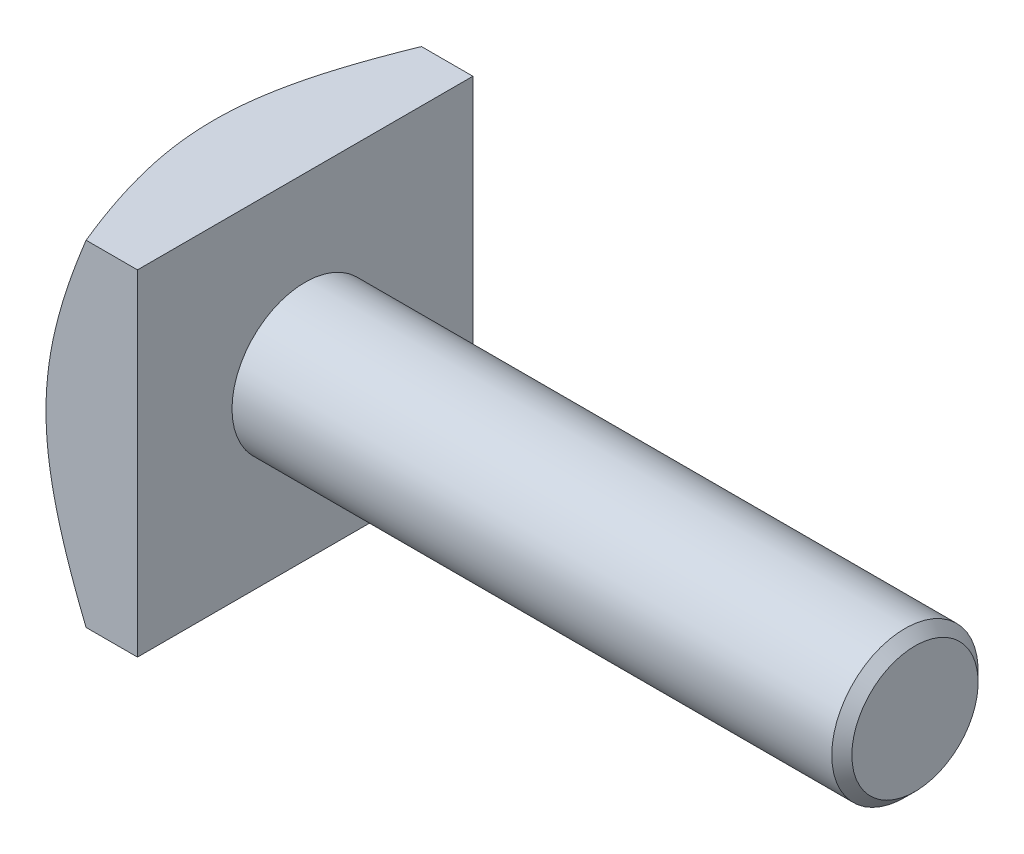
ISO-10303-21;
HEADER;
FILE_DESCRIPTION(('STEP AP214'),'2;1');
FILE_NAME('part.step','',(''),(''),'','','');
FILE_SCHEMA(('AUTOMOTIVE_DESIGN { 1 0 10303 214 1 1 1 1 }'));
ENDSEC;
DATA;
#1=APPLICATION_CONTEXT('core data for automotive mechanical design processes');
#2=APPLICATION_PROTOCOL_DEFINITION('international standard','automotive_design',2000,#1);
#3=PRODUCT_CONTEXT('',#1,'mechanical');
#4=PRODUCT('Part','Part','',(#3));
#5=PRODUCT_RELATED_PRODUCT_CATEGORY('part','',(#4));
#6=PRODUCT_DEFINITION_FORMATION('','',#4);
#7=PRODUCT_DEFINITION_CONTEXT('part definition',#1,'design');
#8=PRODUCT_DEFINITION('design','',#6,#7);
#9=PRODUCT_DEFINITION_SHAPE('','',#8);
#10=(LENGTH_UNIT() NAMED_UNIT(*) SI_UNIT(.MILLI.,.METRE.));
#11=(NAMED_UNIT(*) PLANE_ANGLE_UNIT() SI_UNIT($,.RADIAN.));
#12=(NAMED_UNIT(*) SI_UNIT($,.STERADIAN.) SOLID_ANGLE_UNIT());
#13=UNCERTAINTY_MEASURE_WITH_UNIT(LENGTH_MEASURE(1.E-05),#10,'distance_accuracy_value','');
#14=(GEOMETRIC_REPRESENTATION_CONTEXT(3) GLOBAL_UNCERTAINTY_ASSIGNED_CONTEXT((#13)) GLOBAL_UNIT_ASSIGNED_CONTEXT((#10,
#11,#12)) REPRESENTATION_CONTEXT('',''));
#15=CARTESIAN_POINT('',(0.,0.,0.));
#16=DIRECTION('',(0.,0.,1.));
#17=DIRECTION('',(1.,0.,0.));
#18=AXIS2_PLACEMENT_3D('',#15,#16,#17);
#19=CARTESIAN_POINT('',(15.,27.5,27.5));
#20=DIRECTION('',(0.,-1.,0.));
#21=DIRECTION('',(0.,0.,-1.));
#22=AXIS2_PLACEMENT_3D('',#19,#20,#21);
#23=PLANE('',#22);
#24=CARTESIAN_POINT('',(19.2891533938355,27.5,-54.3484403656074));
#25=CARTESIAN_POINT('',(18.9458184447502,27.5,-53.6819659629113));
#26=CARTESIAN_POINT('',(18.6034944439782,27.5,-53.0149710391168));
#27=CARTESIAN_POINT('',(17.9210859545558,27.5,-51.6798335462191));
#28=CARTESIAN_POINT('',(17.5810014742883,27.5,-51.0116909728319));
#29=CARTESIAN_POINT('',(16.5643984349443,27.5,-49.0053120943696));
#30=CARTESIAN_POINT('',(15.8915699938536,27.5,-47.6652016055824));
#31=CARTESIAN_POINT('',(14.5564181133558,27.5,-44.9758303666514));
#32=CARTESIAN_POINT('',(13.8941230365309,27.5,-43.6265555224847));
#33=CARTESIAN_POINT('',(12.5845998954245,27.5,-40.9207246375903));
#34=CARTESIAN_POINT('',(11.9373715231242,27.5,-39.564168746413));
#35=CARTESIAN_POINT('',(10.9630663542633,27.5,-37.4848533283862));
#36=CARTESIAN_POINT('',(10.6291345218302,27.5,-36.7653040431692));
#37=CARTESIAN_POINT('',(9.96729958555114,27.5,-35.3234400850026));
#38=CARTESIAN_POINT('',(9.63939644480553,27.5,-34.6011254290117));
#39=CARTESIAN_POINT('',(8.99043429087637,27.5,-33.1533670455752));
#40=CARTESIAN_POINT('',(8.66937573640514,27.5,-32.4279231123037));
#41=CARTESIAN_POINT('',(8.03511778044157,27.5,-30.9736050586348));
#42=CARTESIAN_POINT('',(7.72191836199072,27.5,-30.2447309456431));
#43=CARTESIAN_POINT('',(7.10481375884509,27.5,-28.7838030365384));
#44=CARTESIAN_POINT('',(6.80090069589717,27.5,-28.0517525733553));
#45=CARTESIAN_POINT('',(6.2034512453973,27.5,-26.5834130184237));
#46=CARTESIAN_POINT('',(5.90991496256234,27.5,-25.8471238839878));
#47=CARTESIAN_POINT('',(5.33486489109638,27.5,-24.3699401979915));
#48=CARTESIAN_POINT('',(5.05334990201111,27.5,-23.6290461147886));
#49=CARTESIAN_POINT('',(4.50421391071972,27.5,-22.1421407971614));
#50=CARTESIAN_POINT('',(4.23659244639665,27.5,-21.3961297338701));
#51=CARTESIAN_POINT('',(3.72031825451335,27.5,-19.9068050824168));
#52=CARTESIAN_POINT('',(3.47148826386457,27.5,-19.1635531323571));
#53=CARTESIAN_POINT('',(2.99205749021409,27.5,-17.6712555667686));
#54=CARTESIAN_POINT('',(2.76145481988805,27.5,-16.9222105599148));
#55=CARTESIAN_POINT('',(2.32125727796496,27.5,-15.4179904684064));
#56=CARTESIAN_POINT('',(2.11166123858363,27.5,-14.6628157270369));
#57=CARTESIAN_POINT('',(1.71648510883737,27.5,-13.1458870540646));
#58=CARTESIAN_POINT('',(1.53091357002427,27.5,-12.3841308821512));
#59=CARTESIAN_POINT('',(1.19051489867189,27.5,-10.8692661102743));
#60=CARTESIAN_POINT('',(1.03516105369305,27.5,-10.1162765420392));
#61=CARTESIAN_POINT('',(0.753974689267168,27.5,-8.60481213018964));
#62=CARTESIAN_POINT('',(0.628140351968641,27.5,-7.84633762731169));
#63=CARTESIAN_POINT('',(0.408972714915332,27.5,-6.32487928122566));
#64=CARTESIAN_POINT('',(0.315630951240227,27.5,-5.5618966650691));
#65=CARTESIAN_POINT('',(0.163897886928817,27.5,-4.03249534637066));
#66=CARTESIAN_POINT('',(0.105502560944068,27.5,-3.2660770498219));
#67=CARTESIAN_POINT('',(0.0411724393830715,27.5,-2.0349416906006));
#68=CARTESIAN_POINT('',(0.0236233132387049,27.5,-1.57080468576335));
#69=CARTESIAN_POINT('',(0.00207140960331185,27.5,-0.642221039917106));
#70=CARTESIAN_POINT('',(-0.0019317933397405,27.5,-0.17777440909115));
#71=CARTESIAN_POINT('',(0.00365633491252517,27.5,0.750991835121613));
#72=CARTESIAN_POINT('',(0.0132464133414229,27.5,1.21531145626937));
#73=CARTESIAN_POINT('',(0.045910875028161,27.5,2.14347939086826));
#74=CARTESIAN_POINT('',(0.0689854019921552,27.5,2.60732769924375));
#75=CARTESIAN_POINT('',(0.128376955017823,27.5,3.53428731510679));
#76=CARTESIAN_POINT('',(0.164697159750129,27.5,3.99739841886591));
#77=CARTESIAN_POINT('',(0.250192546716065,27.5,4.92243936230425));
#78=CARTESIAN_POINT('',(0.299368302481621,27.5,5.38436914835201));
#79=CARTESIAN_POINT('',(0.465466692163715,27.5,6.7679240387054));
#80=CARTESIAN_POINT('',(0.60096411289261,27.5,7.68737025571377));
#81=CARTESIAN_POINT('',(0.92090866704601,27.5,9.54355013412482));
#82=CARTESIAN_POINT('',(1.10659671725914,27.5,10.4800660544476));
#83=CARTESIAN_POINT('',(1.51905836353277,27.5,12.3439711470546));
#84=CARTESIAN_POINT('',(1.74583266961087,27.5,13.2713601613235));
#85=CARTESIAN_POINT('',(2.11237664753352,27.5,14.6555610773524));
#86=CARTESIAN_POINT('',(2.238987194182,27.5,15.1159192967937));
#87=CARTESIAN_POINT('',(2.50030239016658,27.5,16.0343381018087));
#88=CARTESIAN_POINT('',(2.63500703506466,27.5,16.4923986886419));
#89=CARTESIAN_POINT('',(2.91183323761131,27.5,17.406234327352));
#90=CARTESIAN_POINT('',(3.05395430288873,27.5,17.8620095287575));
#91=CARTESIAN_POINT('',(3.34500261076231,27.5,18.7713766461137));
#92=CARTESIAN_POINT('',(3.4939298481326,27.5,19.2249685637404));
#93=CARTESIAN_POINT('',(3.92985785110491,27.5,20.5225041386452));
#94=CARTESIAN_POINT('',(4.2246003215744,27.5,21.3638532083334));
#95=CARTESIAN_POINT('',(4.83246498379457,27.5,23.0399078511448));
#96=CARTESIAN_POINT('',(5.14558833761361,27.5,23.8746130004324));
#97=CARTESIAN_POINT('',(5.78748401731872,27.5,25.5382017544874));
#98=CARTESIAN_POINT('',(6.11626009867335,27.5,26.3670839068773));
#99=CARTESIAN_POINT('',(6.78704116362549,27.5,28.0194458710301));
#100=CARTESIAN_POINT('',(7.12904589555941,27.5,28.8429257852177));
#101=CARTESIAN_POINT('',(7.82467615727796,27.5,30.4858876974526));
#102=CARTESIAN_POINT('',(8.17831254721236,27.5,31.3053650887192));
#103=CARTESIAN_POINT('',(8.89526950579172,27.5,32.940069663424));
#104=CARTESIAN_POINT('',(9.2585901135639,27.5,33.755296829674));
#105=CARTESIAN_POINT('',(9.99351768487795,27.5,35.3818866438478));
#106=CARTESIAN_POINT('',(10.365123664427,27.5,36.1932497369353));
#107=CARTESIAN_POINT('',(11.1155341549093,27.5,37.8126348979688));
#108=CARTESIAN_POINT('',(11.4943386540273,27.5,38.620656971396));
#109=CARTESIAN_POINT('',(12.2594790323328,27.5,40.2364395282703));
#110=CARTESIAN_POINT('',(12.6458358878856,27.5,41.0441900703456));
#111=CARTESIAN_POINT('',(13.4240464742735,27.5,42.6570404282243));
#112=CARTESIAN_POINT('',(13.8159002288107,27.5,43.4621402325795));
#113=CARTESIAN_POINT('',(14.9986724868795,27.5,45.8739334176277));
#114=CARTESIAN_POINT('',(15.7967909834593,27.5,47.4770974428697));
#115=CARTESIAN_POINT('',(17.4074889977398,27.5,50.6750172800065));
#116=CARTESIAN_POINT('',(18.220060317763,27.5,52.2697772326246));
#117=CARTESIAN_POINT('',(19.8569996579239,27.5,55.4532089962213));
#118=CARTESIAN_POINT('',(20.6813675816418,27.5,57.0418808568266));
#119=CARTESIAN_POINT('',(22.227938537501,27.5,60.0006536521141));
#120=CARTESIAN_POINT('',(22.9489499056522,27.5,61.3713782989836));
#121=CARTESIAN_POINT('',(24.3969253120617,27.5,64.1096818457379));
#122=CARTESIAN_POINT('',(25.1238893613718,27.5,65.4772607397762));
#123=CARTESIAN_POINT('',(26.5829525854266,27.5,68.2099451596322));
#124=CARTESIAN_POINT('',(27.3150525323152,27.5,69.5750502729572));
#125=CARTESIAN_POINT('',(28.7835313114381,27.5,72.302957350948));
#126=CARTESIAN_POINT('',(29.5199101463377,27.5,73.6657593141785));
#127=CARTESIAN_POINT('',(30.9913075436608,27.5,76.3800929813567));
#128=CARTESIAN_POINT('',(31.7263011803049,27.5,77.7316382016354));
#129=CARTESIAN_POINT('',(33.1994205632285,27.5,80.4330209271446));
#130=CARTESIAN_POINT('',(33.9375463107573,27.5,81.7828584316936));
#131=CARTESIAN_POINT('',(35.4163878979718,27.5,84.4807988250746));
#132=CARTESIAN_POINT('',(36.1571032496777,27.5,85.8289019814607));
#133=CARTESIAN_POINT('',(37.640926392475,27.5,88.5237882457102));
#134=CARTESIAN_POINT('',(38.3840341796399,27.5,89.8705713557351));
#135=CARTESIAN_POINT('',(39.1281747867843,27.5,91.2167827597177));
#136=B_SPLINE_CURVE_WITH_KNOTS('',3,(#24,#25,#26,#27,#28,#29,#30,#31,#32,#33,#34,#35,#36,#37,
#38,#39,#40,#41,#42,#43,#44,#45,#46,#47,#48,#49,#50,#51,#52,#53,#54,#55,#56,#57,#58,#59,#60,#61,
#62,#63,#64,#65,#66,#67,#68,#69,#70,#71,#72,#73,#74,#75,#76,#77,#78,#79,#80,#81,#82,#83,#84,#85,
#86,#87,#88,#89,#90,#91,#92,#93,#94,#95,#96,#97,#98,#99,#100,#101,#102,#103,#104,#105,#106,#107,
#108,#109,#110,#111,#112,#113,#114,#115,#116,#117,#118,#119,#120,#121,#122,#123,#124,#125,#126,
#127,#128,#129,#130,#131,#132,#133,#134,#135),.UNSPECIFIED.,.F.,.F.,(4,2,2,2,2,2,2,2,2,2,2,2,2,
2,2,2,2,2,2,2,2,2,2,2,2,2,2,2,2,2,2,2,2,2,2,2,2,2,2,2,2,2,2,2,2,2,2,2,2,2,2,2,2,2,2,4),(0.,
2.2491320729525,4.49827255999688,8.99681337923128,13.5059126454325,18.0149196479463,
20.3946776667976,22.7744211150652,25.1543235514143,27.5342208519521,29.9120396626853,
32.2898824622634,34.6674872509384,37.0450129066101,39.3962057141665,41.7471547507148,
44.0979730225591,46.4496257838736,48.7556452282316,51.0615226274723,53.3667989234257,
55.6718096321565,57.0650406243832,58.4582278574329,59.8512867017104,61.2443603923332,
62.6377686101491,64.0312390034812,66.8180129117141,69.681239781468,72.5445161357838,
73.9768128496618,75.4091087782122,76.8413097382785,78.2735095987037,80.9476779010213,
83.6220154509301,86.2969979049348,88.9719294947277,91.6494337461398,94.3269488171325,
97.004147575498,99.6813419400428,102.367503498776,105.053676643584,110.426099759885,
115.795567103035,121.164990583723,125.811337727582,130.457693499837,135.104763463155,
139.751836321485,144.367241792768,148.982649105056,153.597229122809,158.211801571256),.UNSPECIFIED.);
#137=CARTESIAN_POINT('',(6.57652357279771,27.5,27.5));
#138=VERTEX_POINT('',#137);
#139=CARTESIAN_POINT('',(0.,27.5,0.));
#140=VERTEX_POINT('',#139);
#141=EDGE_CURVE('E86',#138,#140,#136,.F.);
#142=ORIENTED_EDGE('',*,*,#141,.F.);
#143=DIRECTION('',(-1.,0.,0.));
#144=VECTOR('',#143,1.);
#145=CARTESIAN_POINT('',(15.,27.5,27.5));
#146=LINE('',#145,#144);
#147=CARTESIAN_POINT('',(15.,27.5,27.5));
#148=VERTEX_POINT('',#147);
#149=EDGE_CURVE('E176',#148,#138,#146,.T.);
#150=ORIENTED_EDGE('',*,*,#149,.F.);
#151=DIRECTION('',(0.,0.,1.));
#152=VECTOR('',#151,1.);
#153=CARTESIAN_POINT('',(15.,27.5,27.5));
#154=LINE('',#153,#152);
#155=CARTESIAN_POINT('',(15.,27.5,-27.5));
#156=VERTEX_POINT('',#155);
#157=EDGE_CURVE('E189',#156,#148,#154,.T.);
#158=ORIENTED_EDGE('',*,*,#157,.F.);
#159=DIRECTION('',(-1.,0.,0.));
#160=VECTOR('',#159,1.);
#161=CARTESIAN_POINT('',(15.,27.5,-27.5));
#162=LINE('',#161,#160);
#163=CARTESIAN_POINT('',(6.57652357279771,27.5,-27.5));
#164=VERTEX_POINT('',#163);
#165=EDGE_CURVE('E111',#156,#164,#162,.T.);
#166=ORIENTED_EDGE('',*,*,#165,.T.);
#167=EDGE_CURVE('E95',#140,#164,#136,.F.);
#168=ORIENTED_EDGE('',*,*,#167,.F.);
#169=EDGE_LOOP('',(#142,#150,#158,#166,#168));
#170=FACE_BOUND('',#169,.T.);
#171=ADVANCED_FACE('F35',(#170),#23,.F.);
#172=CARTESIAN_POINT('',(15.,27.5,27.5));
#173=DIRECTION('',(0.,0.,-1.));
#174=DIRECTION('',(0.,1.,0.));
#175=AXIS2_PLACEMENT_3D('',#172,#173,#174);
#176=PLANE('',#175);
#177=CARTESIAN_POINT('',(19.2891533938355,-54.3484403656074,27.5));
#178=CARTESIAN_POINT('',(18.9458184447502,-53.6819659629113,27.5));
#179=CARTESIAN_POINT('',(18.6034944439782,-53.0149710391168,27.5));
#180=CARTESIAN_POINT('',(17.9210859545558,-51.6798335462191,27.5));
#181=CARTESIAN_POINT('',(17.5810014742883,-51.0116909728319,27.5));
#182=CARTESIAN_POINT('',(16.5643984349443,-49.0053120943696,27.5));
#183=CARTESIAN_POINT('',(15.8915699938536,-47.6652016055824,27.5));
#184=CARTESIAN_POINT('',(14.5564181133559,-44.9758303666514,27.5));
#185=CARTESIAN_POINT('',(13.8941230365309,-43.6265555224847,27.5));
#186=CARTESIAN_POINT('',(12.5845998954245,-40.9207246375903,27.5));
#187=CARTESIAN_POINT('',(11.9373715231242,-39.564168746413,27.5));
#188=CARTESIAN_POINT('',(10.9630663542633,-37.4848533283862,27.5));
#189=CARTESIAN_POINT('',(10.6291345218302,-36.7653040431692,27.5));
#190=CARTESIAN_POINT('',(9.96729958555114,-35.3234400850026,27.5));
#191=CARTESIAN_POINT('',(9.63939644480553,-34.6011254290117,27.5));
#192=CARTESIAN_POINT('',(8.99043429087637,-33.1533670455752,27.5));
#193=CARTESIAN_POINT('',(8.66937573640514,-32.4279231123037,27.5));
#194=CARTESIAN_POINT('',(8.03511778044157,-30.9736050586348,27.5));
#195=CARTESIAN_POINT('',(7.72191836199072,-30.2447309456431,27.5));
#196=CARTESIAN_POINT('',(7.10481375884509,-28.7838030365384,27.5));
#197=CARTESIAN_POINT('',(6.80090069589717,-28.0517525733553,27.5));
#198=CARTESIAN_POINT('',(6.20345124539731,-26.5834130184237,27.5));
#199=CARTESIAN_POINT('',(5.90991496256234,-25.8471238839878,27.5));
#200=CARTESIAN_POINT('',(5.33486489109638,-24.3699401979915,27.5));
#201=CARTESIAN_POINT('',(5.05334990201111,-23.6290461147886,27.5));
#202=CARTESIAN_POINT('',(4.50421391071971,-22.1421407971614,27.5));
#203=CARTESIAN_POINT('',(4.23659244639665,-21.3961297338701,27.5));
#204=CARTESIAN_POINT('',(3.72031825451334,-19.9068050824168,27.5));
#205=CARTESIAN_POINT('',(3.47148826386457,-19.1635531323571,27.5));
#206=CARTESIAN_POINT('',(2.99205749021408,-17.6712555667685,27.5));
#207=CARTESIAN_POINT('',(2.76145481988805,-16.9222105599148,27.5));
#208=CARTESIAN_POINT('',(2.32125727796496,-15.4179904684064,27.5));
#209=CARTESIAN_POINT('',(2.11166123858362,-14.6628157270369,27.5));
#210=CARTESIAN_POINT('',(1.71648510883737,-13.1458870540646,27.5));
#211=CARTESIAN_POINT('',(1.53091357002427,-12.3841308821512,27.5));
#212=CARTESIAN_POINT('',(1.19051489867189,-10.8692661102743,27.5));
#213=CARTESIAN_POINT('',(1.03516105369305,-10.1162765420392,27.5));
#214=CARTESIAN_POINT('',(0.753974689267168,-8.60481213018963,27.5));
#215=CARTESIAN_POINT('',(0.628140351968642,-7.84633762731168,27.5));
#216=CARTESIAN_POINT('',(0.408972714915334,-6.32487928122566,27.5));
#217=CARTESIAN_POINT('',(0.315630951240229,-5.56189666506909,27.5));
#218=CARTESIAN_POINT('',(0.163897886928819,-4.03249534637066,27.5));
#219=CARTESIAN_POINT('',(0.10550256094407,-3.2660770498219,27.5));
#220=CARTESIAN_POINT('',(0.0411724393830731,-2.0349416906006,27.5));
#221=CARTESIAN_POINT('',(0.0236233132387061,-1.57080468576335,27.5));
#222=CARTESIAN_POINT('',(0.00207140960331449,-0.642221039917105,27.5));
#223=CARTESIAN_POINT('',(-0.00193179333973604,-0.177774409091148,27.5));
#224=CARTESIAN_POINT('',(0.00365633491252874,0.750991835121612,27.5));
#225=CARTESIAN_POINT('',(0.0132464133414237,1.21531145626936,27.5));
#226=CARTESIAN_POINT('',(0.0459108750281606,2.14347939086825,27.5));
#227=CARTESIAN_POINT('',(0.0689854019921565,2.60732769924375,27.5));
#228=CARTESIAN_POINT('',(0.128376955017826,3.5342873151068,27.5));
#229=CARTESIAN_POINT('',(0.164697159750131,3.99739841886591,27.5));
#230=CARTESIAN_POINT('',(0.250192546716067,4.92243936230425,27.5));
#231=CARTESIAN_POINT('',(0.299368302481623,5.38436914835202,27.5));
#232=CARTESIAN_POINT('',(0.465466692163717,6.7679240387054,27.5));
#233=CARTESIAN_POINT('',(0.600964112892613,7.68737025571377,27.5));
#234=CARTESIAN_POINT('',(0.920908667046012,9.54355013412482,27.5));
#235=CARTESIAN_POINT('',(1.10659671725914,10.4800660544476,27.5));
#236=CARTESIAN_POINT('',(1.51905836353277,12.3439711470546,27.5));
#237=CARTESIAN_POINT('',(1.74583266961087,13.2713601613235,27.5));
#238=CARTESIAN_POINT('',(2.11237664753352,14.6555610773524,27.5));
#239=CARTESIAN_POINT('',(2.238987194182,15.1159192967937,27.5));
#240=CARTESIAN_POINT('',(2.50030239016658,16.0343381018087,27.5));
#241=CARTESIAN_POINT('',(2.63500703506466,16.4923986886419,27.5));
#242=CARTESIAN_POINT('',(2.9118332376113,17.406234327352,27.5));
#243=CARTESIAN_POINT('',(3.05395430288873,17.8620095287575,27.5));
#244=CARTESIAN_POINT('',(3.34500261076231,18.7713766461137,27.5));
#245=CARTESIAN_POINT('',(3.4939298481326,19.2249685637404,27.5));
#246=CARTESIAN_POINT('',(3.92985785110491,20.5225041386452,27.5));
#247=CARTESIAN_POINT('',(4.2246003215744,21.3638532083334,27.5));
#248=CARTESIAN_POINT('',(4.83246498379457,23.0399078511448,27.5));
#249=CARTESIAN_POINT('',(5.14558833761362,23.8746130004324,27.5));
#250=CARTESIAN_POINT('',(5.78748401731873,25.5382017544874,27.5));
#251=CARTESIAN_POINT('',(6.11626009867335,26.3670839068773,27.5));
#252=CARTESIAN_POINT('',(6.78704116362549,28.0194458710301,27.5));
#253=CARTESIAN_POINT('',(7.12904589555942,28.8429257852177,27.5));
#254=CARTESIAN_POINT('',(7.82467615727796,30.4858876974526,27.5));
#255=CARTESIAN_POINT('',(8.17831254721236,31.3053650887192,27.5));
#256=CARTESIAN_POINT('',(8.89526950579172,32.940069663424,27.5));
#257=CARTESIAN_POINT('',(9.2585901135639,33.755296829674,27.5));
#258=CARTESIAN_POINT('',(9.99351768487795,35.3818866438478,27.5));
#259=CARTESIAN_POINT('',(10.365123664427,36.1932497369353,27.5));
#260=CARTESIAN_POINT('',(11.1155341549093,37.8126348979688,27.5));
#261=CARTESIAN_POINT('',(11.4943386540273,38.620656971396,27.5));
#262=CARTESIAN_POINT('',(12.2594790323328,40.2364395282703,27.5));
#263=CARTESIAN_POINT('',(12.6458358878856,41.0441900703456,27.5));
#264=CARTESIAN_POINT('',(13.4240464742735,42.6570404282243,27.5));
#265=CARTESIAN_POINT('',(13.8159002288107,43.4621402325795,27.5));
#266=CARTESIAN_POINT('',(14.9986724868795,45.8739334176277,27.5));
#267=CARTESIAN_POINT('',(15.7967909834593,47.4770974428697,27.5));
#268=CARTESIAN_POINT('',(17.4074889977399,50.6750172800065,27.5));
#269=CARTESIAN_POINT('',(18.220060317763,52.2697772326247,27.5));
#270=CARTESIAN_POINT('',(19.8569996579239,55.4532089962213,27.5));
#271=CARTESIAN_POINT('',(20.6813675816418,57.0418808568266,27.5));
#272=CARTESIAN_POINT('',(22.227938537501,60.0006536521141,27.5));
#273=CARTESIAN_POINT('',(22.9489499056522,61.3713782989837,27.5));
#274=CARTESIAN_POINT('',(24.3969253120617,64.109681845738,27.5));
#275=CARTESIAN_POINT('',(25.1238893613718,65.4772607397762,27.5));
#276=CARTESIAN_POINT('',(26.5829525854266,68.2099451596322,27.5));
#277=CARTESIAN_POINT('',(27.3150525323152,69.5750502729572,27.5));
#278=CARTESIAN_POINT('',(28.7835313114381,72.302957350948,27.5));
#279=CARTESIAN_POINT('',(29.5199101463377,73.6657593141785,27.5));
#280=CARTESIAN_POINT('',(30.9913075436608,76.3800929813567,27.5));
#281=CARTESIAN_POINT('',(31.7263011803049,77.7316382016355,27.5));
#282=CARTESIAN_POINT('',(33.1994205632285,80.4330209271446,27.5));
#283=CARTESIAN_POINT('',(33.9375463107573,81.7828584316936,27.5));
#284=CARTESIAN_POINT('',(35.4163878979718,84.4807988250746,27.5));
#285=CARTESIAN_POINT('',(36.1571032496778,85.8289019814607,27.5));
#286=CARTESIAN_POINT('',(37.640926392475,88.5237882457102,27.5));
#287=CARTESIAN_POINT('',(38.3840341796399,89.8705713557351,27.5));
#288=CARTESIAN_POINT('',(39.1281747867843,91.2167827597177,27.5));
#289=B_SPLINE_CURVE_WITH_KNOTS('',3,(#177,#178,#179,#180,#181,#182,#183,#184,#185,#186,#187,
#188,#189,#190,#191,#192,#193,#194,#195,#196,#197,#198,#199,#200,#201,#202,#203,#204,#205,#206,
#207,#208,#209,#210,#211,#212,#213,#214,#215,#216,#217,#218,#219,#220,#221,#222,#223,#224,#225,
#226,#227,#228,#229,#230,#231,#232,#233,#234,#235,#236,#237,#238,#239,#240,#241,#242,#243,#244,
#245,#246,#247,#248,#249,#250,#251,#252,#253,#254,#255,#256,#257,#258,#259,#260,#261,#262,#263,
#264,#265,#266,#267,#268,#269,#270,#271,#272,#273,#274,#275,#276,#277,#278,#279,#280,#281,#282,
#283,#284,#285,#286,#287,#288),.UNSPECIFIED.,.F.,.F.,(4,2,2,2,2,2,2,2,2,2,2,2,2,2,2,2,2,2,2,2,2,
2,2,2,2,2,2,2,2,2,2,2,2,2,2,2,2,2,2,2,2,2,2,2,2,2,2,2,2,2,2,2,2,2,2,4),(0.,2.2491320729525,
4.49827255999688,8.99681337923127,13.5059126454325,18.0149196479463,20.3946776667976,
22.7744211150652,25.1543235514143,27.5342208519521,29.9120396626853,32.2898824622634,
34.6674872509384,37.0450129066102,39.3962057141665,41.7471547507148,44.0979730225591,
46.4496257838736,48.7556452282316,51.0615226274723,53.3667989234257,55.6718096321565,
57.0650406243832,58.4582278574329,59.8512867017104,61.2443603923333,62.6377686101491,
64.0312390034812,66.8180129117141,69.681239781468,72.5445161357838,73.9768128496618,
75.4091087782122,76.8413097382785,78.2735095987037,80.9476779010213,83.6220154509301,
86.2969979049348,88.9719294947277,91.6494337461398,94.3269488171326,97.0041475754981,
99.6813419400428,102.367503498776,105.053676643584,110.426099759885,115.795567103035,
121.164990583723,125.811337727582,130.457693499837,135.104763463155,139.751836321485,
144.367241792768,148.982649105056,153.597229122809,158.211801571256),.UNSPECIFIED.);
#290=CARTESIAN_POINT('',(6.57652357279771,-27.5,27.5));
#291=VERTEX_POINT('',#290);
#292=CARTESIAN_POINT('',(0.,0.,27.5));
#293=VERTEX_POINT('',#292);
#294=EDGE_CURVE('E167',#291,#293,#289,.T.);
#295=ORIENTED_EDGE('',*,*,#294,.F.);
#296=DIRECTION('',(-1.,0.,0.));
#297=VECTOR('',#296,1.);
#298=CARTESIAN_POINT('',(15.,-27.5,27.5));
#299=LINE('',#298,#297);
#300=CARTESIAN_POINT('',(15.,-27.5,27.5));
#301=VERTEX_POINT('',#300);
#302=EDGE_CURVE('E169',#301,#291,#299,.T.);
#303=ORIENTED_EDGE('',*,*,#302,.F.);
#304=DIRECTION('',(0.,-1.,0.));
#305=VECTOR('',#304,1.);
#306=CARTESIAN_POINT('',(15.,27.5,27.5));
#307=LINE('',#306,#305);
#308=EDGE_CURVE('E187',#148,#301,#307,.T.);
#309=ORIENTED_EDGE('',*,*,#308,.F.);
#310=ORIENTED_EDGE('',*,*,#149,.T.);
#311=EDGE_CURVE('E89',#293,#138,#289,.T.);
#312=ORIENTED_EDGE('',*,*,#311,.F.);
#313=EDGE_LOOP('',(#295,#303,#309,#310,#312));
#314=FACE_BOUND('',#313,.T.);
#315=ADVANCED_FACE('F157',(#314),#176,.F.);
#316=CARTESIAN_POINT('',(15.,-27.5,27.5));
#317=DIRECTION('',(0.,1.,0.));
#318=DIRECTION('',(0.,0.,1.));
#319=AXIS2_PLACEMENT_3D('',#316,#317,#318);
#320=PLANE('',#319);
#321=CARTESIAN_POINT('',(19.2891533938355,-27.5,-54.3484403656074));
#322=CARTESIAN_POINT('',(18.9458184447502,-27.5,-53.6819659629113));
#323=CARTESIAN_POINT('',(18.6034944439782,-27.5,-53.0149710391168));
#324=CARTESIAN_POINT('',(17.9210859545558,-27.5,-51.6798335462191));
#325=CARTESIAN_POINT('',(17.5810014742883,-27.5,-51.0116909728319));
#326=CARTESIAN_POINT('',(16.5643984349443,-27.5,-49.0053120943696));
#327=CARTESIAN_POINT('',(15.8915699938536,-27.5,-47.6652016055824));
#328=CARTESIAN_POINT('',(14.5564181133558,-27.5,-44.9758303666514));
#329=CARTESIAN_POINT('',(13.8941230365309,-27.5,-43.6265555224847));
#330=CARTESIAN_POINT('',(12.5845998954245,-27.5,-40.9207246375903));
#331=CARTESIAN_POINT('',(11.9373715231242,-27.5,-39.564168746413));
#332=CARTESIAN_POINT('',(10.9630663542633,-27.5,-37.4848533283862));
#333=CARTESIAN_POINT('',(10.6291345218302,-27.5,-36.7653040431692));
#334=CARTESIAN_POINT('',(9.96729958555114,-27.5,-35.3234400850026));
#335=CARTESIAN_POINT('',(9.63939644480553,-27.5,-34.6011254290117));
#336=CARTESIAN_POINT('',(8.99043429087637,-27.5,-33.1533670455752));
#337=CARTESIAN_POINT('',(8.66937573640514,-27.5,-32.4279231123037));
#338=CARTESIAN_POINT('',(8.03511778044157,-27.5,-30.9736050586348));
#339=CARTESIAN_POINT('',(7.72191836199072,-27.5,-30.2447309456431));
#340=CARTESIAN_POINT('',(7.10481375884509,-27.5,-28.7838030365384));
#341=CARTESIAN_POINT('',(6.80090069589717,-27.5,-28.0517525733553));
#342=CARTESIAN_POINT('',(6.2034512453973,-27.5,-26.5834130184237));
#343=CARTESIAN_POINT('',(5.90991496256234,-27.5,-25.8471238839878));
#344=CARTESIAN_POINT('',(5.33486489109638,-27.5,-24.3699401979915));
#345=CARTESIAN_POINT('',(5.05334990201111,-27.5,-23.6290461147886));
#346=CARTESIAN_POINT('',(4.50421391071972,-27.5,-22.1421407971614));
#347=CARTESIAN_POINT('',(4.23659244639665,-27.5,-21.3961297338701));
#348=CARTESIAN_POINT('',(3.72031825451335,-27.5,-19.9068050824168));
#349=CARTESIAN_POINT('',(3.47148826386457,-27.5,-19.1635531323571));
#350=CARTESIAN_POINT('',(2.99205749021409,-27.5,-17.6712555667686));
#351=CARTESIAN_POINT('',(2.76145481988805,-27.5,-16.9222105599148));
#352=CARTESIAN_POINT('',(2.32125727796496,-27.5,-15.4179904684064));
#353=CARTESIAN_POINT('',(2.11166123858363,-27.5,-14.6628157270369));
#354=CARTESIAN_POINT('',(1.71648510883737,-27.5,-13.1458870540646));
#355=CARTESIAN_POINT('',(1.53091357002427,-27.5,-12.3841308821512));
#356=CARTESIAN_POINT('',(1.19051489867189,-27.5,-10.8692661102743));
#357=CARTESIAN_POINT('',(1.03516105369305,-27.5,-10.1162765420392));
#358=CARTESIAN_POINT('',(0.753974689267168,-27.5,-8.60481213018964));
#359=CARTESIAN_POINT('',(0.628140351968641,-27.5,-7.84633762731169));
#360=CARTESIAN_POINT('',(0.408972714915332,-27.5,-6.32487928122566));
#361=CARTESIAN_POINT('',(0.315630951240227,-27.5,-5.5618966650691));
#362=CARTESIAN_POINT('',(0.163897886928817,-27.5,-4.03249534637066));
#363=CARTESIAN_POINT('',(0.105502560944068,-27.5,-3.2660770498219));
#364=CARTESIAN_POINT('',(0.0411724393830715,-27.5,-2.0349416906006));
#365=CARTESIAN_POINT('',(0.0236233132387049,-27.5,-1.57080468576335));
#366=CARTESIAN_POINT('',(0.00207140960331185,-27.5,-0.642221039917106));
#367=CARTESIAN_POINT('',(-0.0019317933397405,-27.5,-0.17777440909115));
#368=CARTESIAN_POINT('',(0.00365633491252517,-27.5,0.750991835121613));
#369=CARTESIAN_POINT('',(0.0132464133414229,-27.5,1.21531145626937));
#370=CARTESIAN_POINT('',(0.045910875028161,-27.5,2.14347939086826));
#371=CARTESIAN_POINT('',(0.0689854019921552,-27.5,2.60732769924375));
#372=CARTESIAN_POINT('',(0.128376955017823,-27.5,3.53428731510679));
#373=CARTESIAN_POINT('',(0.164697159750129,-27.5,3.99739841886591));
#374=CARTESIAN_POINT('',(0.250192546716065,-27.5,4.92243936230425));
#375=CARTESIAN_POINT('',(0.299368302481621,-27.5,5.38436914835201));
#376=CARTESIAN_POINT('',(0.465466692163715,-27.5,6.7679240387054));
#377=CARTESIAN_POINT('',(0.60096411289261,-27.5,7.68737025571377));
#378=CARTESIAN_POINT('',(0.92090866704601,-27.5,9.54355013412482));
#379=CARTESIAN_POINT('',(1.10659671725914,-27.5,10.4800660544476));
#380=CARTESIAN_POINT('',(1.51905836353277,-27.5,12.3439711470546));
#381=CARTESIAN_POINT('',(1.74583266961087,-27.5,13.2713601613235));
#382=CARTESIAN_POINT('',(2.11237664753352,-27.5,14.6555610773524));
#383=CARTESIAN_POINT('',(2.238987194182,-27.5,15.1159192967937));
#384=CARTESIAN_POINT('',(2.50030239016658,-27.5,16.0343381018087));
#385=CARTESIAN_POINT('',(2.63500703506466,-27.5,16.4923986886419));
#386=CARTESIAN_POINT('',(2.91183323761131,-27.5,17.406234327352));
#387=CARTESIAN_POINT('',(3.05395430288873,-27.5,17.8620095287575));
#388=CARTESIAN_POINT('',(3.34500261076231,-27.5,18.7713766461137));
#389=CARTESIAN_POINT('',(3.4939298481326,-27.5,19.2249685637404));
#390=CARTESIAN_POINT('',(3.92985785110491,-27.5,20.5225041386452));
#391=CARTESIAN_POINT('',(4.2246003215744,-27.5,21.3638532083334));
#392=CARTESIAN_POINT('',(4.83246498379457,-27.5,23.0399078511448));
#393=CARTESIAN_POINT('',(5.14558833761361,-27.5,23.8746130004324));
#394=CARTESIAN_POINT('',(5.78748401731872,-27.5,25.5382017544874));
#395=CARTESIAN_POINT('',(6.11626009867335,-27.5,26.3670839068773));
#396=CARTESIAN_POINT('',(6.78704116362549,-27.5,28.0194458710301));
#397=CARTESIAN_POINT('',(7.12904589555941,-27.5,28.8429257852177));
#398=CARTESIAN_POINT('',(7.82467615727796,-27.5,30.4858876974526));
#399=CARTESIAN_POINT('',(8.17831254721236,-27.5,31.3053650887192));
#400=CARTESIAN_POINT('',(8.89526950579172,-27.5,32.940069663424));
#401=CARTESIAN_POINT('',(9.2585901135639,-27.5,33.755296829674));
#402=CARTESIAN_POINT('',(9.99351768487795,-27.5,35.3818866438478));
#403=CARTESIAN_POINT('',(10.365123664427,-27.5,36.1932497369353));
#404=CARTESIAN_POINT('',(11.1155341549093,-27.5,37.8126348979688));
#405=CARTESIAN_POINT('',(11.4943386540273,-27.5,38.620656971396));
#406=CARTESIAN_POINT('',(12.2594790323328,-27.5,40.2364395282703));
#407=CARTESIAN_POINT('',(12.6458358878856,-27.5,41.0441900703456));
#408=CARTESIAN_POINT('',(13.4240464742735,-27.5,42.6570404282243));
#409=CARTESIAN_POINT('',(13.8159002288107,-27.5,43.4621402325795));
#410=CARTESIAN_POINT('',(14.9986724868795,-27.5,45.8739334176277));
#411=CARTESIAN_POINT('',(15.7967909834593,-27.5,47.4770974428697));
#412=CARTESIAN_POINT('',(17.4074889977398,-27.5,50.6750172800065));
#413=CARTESIAN_POINT('',(18.220060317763,-27.5,52.2697772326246));
#414=CARTESIAN_POINT('',(19.8569996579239,-27.5,55.4532089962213));
#415=CARTESIAN_POINT('',(20.6813675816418,-27.5,57.0418808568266));
#416=CARTESIAN_POINT('',(22.227938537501,-27.5,60.0006536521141));
#417=CARTESIAN_POINT('',(22.9489499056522,-27.5,61.3713782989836));
#418=CARTESIAN_POINT('',(24.3969253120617,-27.5,64.1096818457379));
#419=CARTESIAN_POINT('',(25.1238893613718,-27.5,65.4772607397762));
#420=CARTESIAN_POINT('',(26.5829525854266,-27.5,68.2099451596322));
#421=CARTESIAN_POINT('',(27.3150525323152,-27.5,69.5750502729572));
#422=CARTESIAN_POINT('',(28.7835313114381,-27.5,72.302957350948));
#423=CARTESIAN_POINT('',(29.5199101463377,-27.5,73.6657593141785));
#424=CARTESIAN_POINT('',(30.9913075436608,-27.5,76.3800929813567));
#425=CARTESIAN_POINT('',(31.7263011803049,-27.5,77.7316382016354));
#426=CARTESIAN_POINT('',(33.1994205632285,-27.5,80.4330209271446));
#427=CARTESIAN_POINT('',(33.9375463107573,-27.5,81.7828584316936));
#428=CARTESIAN_POINT('',(35.4163878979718,-27.5,84.4807988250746));
#429=CARTESIAN_POINT('',(36.1571032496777,-27.5,85.8289019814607));
#430=CARTESIAN_POINT('',(37.640926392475,-27.5,88.5237882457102));
#431=CARTESIAN_POINT('',(38.3840341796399,-27.5,89.8705713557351));
#432=CARTESIAN_POINT('',(39.1281747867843,-27.5,91.2167827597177));
#433=B_SPLINE_CURVE_WITH_KNOTS('',3,(#321,#322,#323,#324,#325,#326,#327,#328,#329,#330,#331,
#332,#333,#334,#335,#336,#337,#338,#339,#340,#341,#342,#343,#344,#345,#346,#347,#348,#349,#350,
#351,#352,#353,#354,#355,#356,#357,#358,#359,#360,#361,#362,#363,#364,#365,#366,#367,#368,#369,
#370,#371,#372,#373,#374,#375,#376,#377,#378,#379,#380,#381,#382,#383,#384,#385,#386,#387,#388,
#389,#390,#391,#392,#393,#394,#395,#396,#397,#398,#399,#400,#401,#402,#403,#404,#405,#406,#407,
#408,#409,#410,#411,#412,#413,#414,#415,#416,#417,#418,#419,#420,#421,#422,#423,#424,#425,#426,
#427,#428,#429,#430,#431,#432),.UNSPECIFIED.,.F.,.F.,(4,2,2,2,2,2,2,2,2,2,2,2,2,2,2,2,2,2,2,2,2,
2,2,2,2,2,2,2,2,2,2,2,2,2,2,2,2,2,2,2,2,2,2,2,2,2,2,2,2,2,2,2,2,2,2,4),(0.,2.2491320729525,
4.49827255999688,8.99681337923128,13.5059126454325,18.0149196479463,20.3946776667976,
22.7744211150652,25.1543235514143,27.5342208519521,29.9120396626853,32.2898824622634,
34.6674872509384,37.0450129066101,39.3962057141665,41.7471547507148,44.0979730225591,
46.4496257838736,48.7556452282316,51.0615226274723,53.3667989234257,55.6718096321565,
57.0650406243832,58.4582278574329,59.8512867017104,61.2443603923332,62.6377686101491,
64.0312390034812,66.8180129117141,69.681239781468,72.5445161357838,73.9768128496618,
75.4091087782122,76.8413097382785,78.2735095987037,80.9476779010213,83.6220154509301,
86.2969979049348,88.9719294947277,91.6494337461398,94.3269488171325,97.004147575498,
99.6813419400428,102.367503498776,105.053676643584,110.426099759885,115.795567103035,
121.164990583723,125.811337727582,130.457693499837,135.104763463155,139.751836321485,
144.367241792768,148.982649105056,153.597229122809,158.211801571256),.UNSPECIFIED.);
#434=CARTESIAN_POINT('',(6.57652357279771,-27.5,-27.5));
#435=VERTEX_POINT('',#434);
#436=CARTESIAN_POINT('',(0.,-27.5,0.));
#437=VERTEX_POINT('',#436);
#438=EDGE_CURVE('E112',#435,#437,#433,.T.);
#439=ORIENTED_EDGE('',*,*,#438,.F.);
#440=DIRECTION('',(-1.,0.,0.));
#441=VECTOR('',#440,1.);
#442=CARTESIAN_POINT('',(15.,-27.5,-27.5));
#443=LINE('',#442,#441);
#444=CARTESIAN_POINT('',(15.,-27.5,-27.5));
#445=VERTEX_POINT('',#444);
#446=EDGE_CURVE('E177',#445,#435,#443,.T.);
#447=ORIENTED_EDGE('',*,*,#446,.F.);
#448=DIRECTION('',(0.,0.,-1.));
#449=VECTOR('',#448,1.);
#450=CARTESIAN_POINT('',(15.,-27.5,27.5));
#451=LINE('',#450,#449);
#452=EDGE_CURVE('E175',#301,#445,#451,.T.);
#453=ORIENTED_EDGE('',*,*,#452,.F.);
#454=ORIENTED_EDGE('',*,*,#302,.T.);
#455=EDGE_CURVE('E94',#437,#291,#433,.T.);
#456=ORIENTED_EDGE('',*,*,#455,.F.);
#457=EDGE_LOOP('',(#439,#447,#453,#454,#456));
#458=FACE_BOUND('',#457,.T.);
#459=ADVANCED_FACE('F152',(#458),#320,.F.);
#460=CARTESIAN_POINT('',(15.,27.5,-27.5));
#461=DIRECTION('',(0.,0.,1.));
#462=DIRECTION('',(0.,-1.,0.));
#463=AXIS2_PLACEMENT_3D('',#460,#461,#462);
#464=PLANE('',#463);
#465=CARTESIAN_POINT('',(19.2891546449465,-54.3484427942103,-27.5));
#466=CARTESIAN_POINT('',(18.9458196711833,-53.6819683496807,-27.5));
#467=CARTESIAN_POINT('',(18.6034956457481,-53.0149733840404,-27.5));
#468=CARTESIAN_POINT('',(17.9210871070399,-51.6798358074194,-27.5));
#469=CARTESIAN_POINT('',(17.5810026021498,-51.0116931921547,-27.5));
#470=CARTESIAN_POINT('',(16.5643994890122,-49.0053141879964,-27.5));
#471=CARTESIAN_POINT('',(15.8915709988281,-47.6652036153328,-27.5));
#472=CARTESIAN_POINT('',(14.5564190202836,-44.9758322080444,-27.5));
#473=CARTESIAN_POINT('',(13.8941238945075,-43.6265572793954,-27.5));
#474=CARTESIAN_POINT('',(12.5846006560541,-40.9207262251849,-27.5));
#475=CARTESIAN_POINT('',(11.937372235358,-39.5641702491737,-27.5));
#476=CARTESIAN_POINT('',(10.9630669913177,-37.4848546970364,-27.5));
#477=CARTESIAN_POINT('',(10.6291351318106,-36.7653053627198,-27.5));
#478=CARTESIAN_POINT('',(9.96730014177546,-35.3234413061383,-27.5));
#479=CARTESIAN_POINT('',(9.63939697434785,-34.6011266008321,-27.5));
#480=CARTESIAN_POINT('',(8.99043476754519,-33.1533681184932,-27.5));
#481=CARTESIAN_POINT('',(8.66937618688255,-32.4279241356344,-27.5));
#482=CARTESIAN_POINT('',(8.03511817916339,-30.973605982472,-27.5));
#483=CARTESIAN_POINT('',(7.72191873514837,-30.2447318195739,-27.5));
#484=CARTESIAN_POINT('',(7.10481408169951,-28.7838038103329,-27.5));
#485=CARTESIAN_POINT('',(6.80090099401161,-28.0517532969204,-27.5));
#486=CARTESIAN_POINT('',(6.20345149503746,-26.5834136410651,-27.5));
#487=CARTESIAN_POINT('',(5.90991518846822,-25.8471244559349,-27.5));
#488=CARTESIAN_POINT('',(5.33486507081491,-24.3699406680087,-27.5));
#489=CARTESIAN_POINT('',(5.05335005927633,-23.6290465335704,-27.5));
#490=CARTESIAN_POINT('',(4.50421402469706,-22.1421411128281,-27.5));
#491=CARTESIAN_POINT('',(4.23659253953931,-21.3961299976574,-27.5));
#492=CARTESIAN_POINT('',(3.72031830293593,-19.9068052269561,-27.5));
#493=CARTESIAN_POINT('',(3.47148828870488,-19.1635532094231,-27.5));
#494=CARTESIAN_POINT('',(2.99205747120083,-17.6712555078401,-27.5));
#495=CARTESIAN_POINT('',(2.76145478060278,-16.9222104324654,-27.5));
#496=CARTESIAN_POINT('',(2.32125720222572,-15.4179902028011,-27.5));
#497=CARTESIAN_POINT('',(2.11166114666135,-14.6628153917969,-27.5));
#498=CARTESIAN_POINT('',(1.71648498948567,-13.1458865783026,-27.5));
#499=CARTESIAN_POINT('',(1.5309134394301,-12.3841303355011,-27.5));
#500=CARTESIAN_POINT('',(1.19051475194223,-10.8692654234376,-27.5));
#501=CARTESIAN_POINT('',(1.03516090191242,-10.1162757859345,-27.5));
#502=CARTESIAN_POINT('',(0.7539745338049,-8.60481123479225,-27.5));
#503=CARTESIAN_POINT('',(0.628140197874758,-7.84633666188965,-27.5));
#504=CARTESIAN_POINT('',(0.40897257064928,-6.32487817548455,-27.5));
#505=CARTESIAN_POINT('',(0.315630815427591,-5.56189548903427,-27.5));
#506=CARTESIAN_POINT('',(0.163897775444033,-4.0324940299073,-27.5));
#507=CARTESIAN_POINT('',(0.105502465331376,-3.26607566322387,-27.5));
#508=CARTESIAN_POINT('',(0.041172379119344,-2.03494026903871,-27.5));
#509=CARTESIAN_POINT('',(0.0236232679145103,-1.57080329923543,-27.5));
#510=CARTESIAN_POINT('',(0.00207139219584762,-0.642219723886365,-27.5));
#511=CARTESIAN_POINT('',(-0.00193179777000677,-0.177773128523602,-27.5));
#512=CARTESIAN_POINT('',(0.00365635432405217,0.750993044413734,-27.5));
#513=CARTESIAN_POINT('',(0.0132464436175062,1.21531262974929,-27.5));
#514=CARTESIAN_POINT('',(0.0459109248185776,2.14348049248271,-27.5));
#515=CARTESIAN_POINT('',(0.068985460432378,2.60732876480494,-27.5));
#516=CARTESIAN_POINT('',(0.128377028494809,3.53428830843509,-27.5));
#517=CARTESIAN_POINT('',(0.16469723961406,3.99739937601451,-27.5));
#518=CARTESIAN_POINT('',(0.250192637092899,4.9224402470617,-27.5));
#519=CARTESIAN_POINT('',(0.299368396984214,5.38436999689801,-27.5));
#520=CARTESIAN_POINT('',(0.465466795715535,6.76792477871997,-27.5));
#521=CARTESIAN_POINT('',(0.600964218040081,7.68737092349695,-27.5));
#522=CARTESIAN_POINT('',(0.920908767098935,9.54355065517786,-27.5));
#523=CARTESIAN_POINT('',(1.10659681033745,10.4800665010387,-27.5));
#524=CARTESIAN_POINT('',(1.51905843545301,12.343971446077,-27.5));
#525=CARTESIAN_POINT('',(1.74583272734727,13.2713603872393,-27.5));
#526=CARTESIAN_POINT('',(2.11237667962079,14.6555611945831,-27.5));
#527=CARTESIAN_POINT('',(2.23898721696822,15.1159193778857,-27.5));
#528=CARTESIAN_POINT('',(2.50030239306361,16.034338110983,-27.5));
#529=CARTESIAN_POINT('',(2.63500702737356,16.4923986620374,-27.5));
#530=CARTESIAN_POINT('',(2.91183320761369,17.4062342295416,-27.5));
#531=CARTESIAN_POINT('',(3.05395426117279,17.8620093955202,-27.5));
#532=CARTESIAN_POINT('',(3.34500254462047,18.7713764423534,-27.5));
#533=CARTESIAN_POINT('',(3.49392976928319,19.224968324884,-27.5));
#534=CARTESIAN_POINT('',(3.92985775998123,20.5225038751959,-27.5));
#535=CARTESIAN_POINT('',(4.22460023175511,21.3638529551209,-27.5));
#536=CARTESIAN_POINT('',(4.8324648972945,23.0399076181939,-27.5));
#537=CARTESIAN_POINT('',(5.1455882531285,23.8746127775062,-27.5));
#538=CARTESIAN_POINT('',(5.78748393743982,25.5382015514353,-27.5));
#539=CARTESIAN_POINT('',(6.11626002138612,26.3670837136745,-27.5));
#540=CARTESIAN_POINT('',(6.78704109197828,28.0194456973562,-27.5));
#541=CARTESIAN_POINT('',(7.12904582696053,28.8429256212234,-27.5));
#542=CARTESIAN_POINT('',(7.82467609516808,30.4858875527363,-27.5));
#543=CARTESIAN_POINT('',(8.17831248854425,31.305364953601,-27.5));
#544=CARTESIAN_POINT('',(8.89526945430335,32.9400695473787,-27.5));
#545=CARTESIAN_POINT('',(9.25859006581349,33.7552967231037,-27.5));
#546=CARTESIAN_POINT('',(9.99351764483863,35.3818865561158,-27.5));
#547=CARTESIAN_POINT('',(10.3651236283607,36.1932496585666,-27.5));
#548=CARTESIAN_POINT('',(11.1155341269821,37.8126348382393,-27.5));
#549=CARTESIAN_POINT('',(11.4943386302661,38.6206569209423,-27.5));
#550=CARTESIAN_POINT('',(12.259479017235,40.2364394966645,-27.5));
#551=CARTESIAN_POINT('',(12.6458358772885,41.0441900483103,-27.5));
#552=CARTESIAN_POINT('',(13.4240464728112,42.6570404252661,-27.5));
#553=CARTESIAN_POINT('',(13.8159002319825,43.4621402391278,-27.5));
#554=CARTESIAN_POINT('',(14.9986725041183,45.8739334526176,-27.5));
#555=CARTESIAN_POINT('',(15.7967910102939,47.4770974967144,-27.5));
#556=CARTESIAN_POINT('',(17.4074890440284,50.6750173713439,-27.5));
#557=CARTESIAN_POINT('',(18.2200603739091,52.2697773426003,-27.5));
#558=CARTESIAN_POINT('',(19.8569997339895,55.4532091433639,-27.5));
#559=CARTESIAN_POINT('',(20.6813676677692,57.041881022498,-27.5));
#560=CARTESIAN_POINT('',(22.2279386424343,60.0006538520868,-27.5));
#561=CARTESIAN_POINT('',(22.9489500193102,61.3713785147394,-27.5));
#562=CARTESIAN_POINT('',(24.3969254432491,64.1096820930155,-27.5));
#563=CARTESIAN_POINT('',(25.1238895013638,65.4772610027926,-27.5));
#564=CARTESIAN_POINT('',(26.5829527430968,68.2099454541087,-27.5));
#565=CARTESIAN_POINT('',(27.3150526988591,69.5750505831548,-27.5));
#566=CARTESIAN_POINT('',(28.7835314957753,72.3029576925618,-27.5));
#567=CARTESIAN_POINT('',(29.5199103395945,73.6657596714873,-27.5));
#568=CARTESIAN_POINT('',(30.9913077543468,76.3800933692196,-27.5));
#569=CARTESIAN_POINT('',(31.7263013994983,77.7316386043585,-27.5));
#570=CARTESIAN_POINT('',(33.1994207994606,80.433021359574,-27.5));
#571=CARTESIAN_POINT('',(33.9375465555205,81.7828588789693,-27.5));
#572=CARTESIAN_POINT('',(35.4163881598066,84.4807993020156,-27.5));
#573=CARTESIAN_POINT('',(36.1571035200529,85.8289024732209,-27.5));
#574=CARTESIAN_POINT('',(37.6409266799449,88.5237887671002,-27.5));
#575=CARTESIAN_POINT('',(38.3840344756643,89.8705718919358,-27.5));
#576=CARTESIAN_POINT('',(39.1281750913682,91.2167833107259,-27.5));
#577=B_SPLINE_CURVE_WITH_KNOTS('',3,(#465,#466,#467,#468,#469,#470,#471,#472,#473,#474,#475,
#476,#477,#478,#479,#480,#481,#482,#483,#484,#485,#486,#487,#488,#489,#490,#491,#492,#493,#494,
#495,#496,#497,#498,#499,#500,#501,#502,#503,#504,#505,#506,#507,#508,#509,#510,#511,#512,#513,
#514,#515,#516,#517,#518,#519,#520,#521,#522,#523,#524,#525,#526,#527,#528,#529,#530,#531,#532,
#533,#534,#535,#536,#537,#538,#539,#540,#541,#542,#543,#544,#545,#546,#547,#548,#549,#550,#551,
#552,#553,#554,#555,#556,#557,#558,#559,#560,#561,#562,#563,#564,#565,#566,#567,#568,#569,#570,
#571,#572,#573,#574,#575,#576),.UNSPECIFIED.,.F.,.F.,(4,2,2,2,2,2,2,2,2,2,2,2,2,2,2,2,2,2,2,2,2,
2,2,2,2,2,2,2,2,2,2,2,2,2,2,2,2,2,2,2,2,2,2,2,2,2,2,2,2,2,2,2,2,2,2,4),(0.,2.24913221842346,
4.49827285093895,8.99681396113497,13.5059135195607,18.0149208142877,20.3946790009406,
22.7744226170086,25.1543252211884,27.5342226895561,29.9120416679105,32.2898846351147,
34.6674895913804,37.0450154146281,39.3962084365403,41.7471576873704,44.0979761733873,
46.4496291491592,48.7556487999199,51.0615264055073,53.3668029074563,55.6718138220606,
57.0650447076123,58.4582318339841,59.8512905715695,61.2443641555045,62.637772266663,
64.0312425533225,66.8180162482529,69.6812428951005,72.5445190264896,73.976815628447,
75.4091114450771,76.8413122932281,78.2735120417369,80.9476803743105,83.6220179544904,
86.2970004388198,88.9719320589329,91.6494363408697,94.3269514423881,97.0041502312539,
99.6813446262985,102.367506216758,105.053679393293,110.426102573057,115.795569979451,
121.164993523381,125.811340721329,130.457696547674,135.104766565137,139.751839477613,
144.367245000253,148.982652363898,153.597232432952,158.2118049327),.UNSPECIFIED.);
#578=CARTESIAN_POINT('',(0.,0.,-27.5));
#579=VERTEX_POINT('',#578);
#580=EDGE_CURVE('E101',#164,#579,#577,.F.);
#581=ORIENTED_EDGE('',*,*,#580,.F.);
#582=ORIENTED_EDGE('',*,*,#165,.F.);
#583=DIRECTION('',(0.,1.,0.));
#584=VECTOR('',#583,1.);
#585=CARTESIAN_POINT('',(15.,27.5,-27.5));
#586=LINE('',#585,#584);
#587=EDGE_CURVE('E184',#445,#156,#586,.T.);
#588=ORIENTED_EDGE('',*,*,#587,.F.);
#589=ORIENTED_EDGE('',*,*,#446,.T.);
#590=EDGE_CURVE('E106',#579,#435,#577,.F.);
#591=ORIENTED_EDGE('',*,*,#590,.F.);
#592=EDGE_LOOP('',(#581,#582,#588,#589,#591));
#593=FACE_BOUND('',#592,.T.);
#594=ADVANCED_FACE('F147',(#593),#464,.F.);
#595=CARTESIAN_POINT('',(15.,27.5,-27.5));
#596=DIRECTION('',(-1.,0.,0.));
#597=DIRECTION('',(0.,0.,1.));
#598=AXIS2_PLACEMENT_3D('',#595,#596,#597);
#599=PLANE('',#598);
#600=CARTESIAN_POINT('',(15.,0.,0.));
#601=DIRECTION('',(-1.,0.,0.));
#602=DIRECTION('',(0.,0.,1.));
#603=AXIS2_PLACEMENT_3D('',#600,#601,#602);
#604=CIRCLE('',#603,12.);
#605=CARTESIAN_POINT('',(15.,0.,12.));
#606=VERTEX_POINT('',#605);
#607=EDGE_CURVE('E179',#606,#606,#604,.F.);
#608=ORIENTED_EDGE('',*,*,#607,.F.);
#609=EDGE_LOOP('',(#608));
#610=FACE_BOUND('',#609,.T.);
#611=ORIENTED_EDGE('',*,*,#157,.T.);
#612=ORIENTED_EDGE('',*,*,#308,.T.);
#613=ORIENTED_EDGE('',*,*,#452,.T.);
#614=ORIENTED_EDGE('',*,*,#587,.T.);
#615=EDGE_LOOP('',(#611,#612,#613,#614));
#616=FACE_BOUND('',#615,.T.);
#617=ADVANCED_FACE('F151',(#610,#616),#599,.F.);
#618=CARTESIAN_POINT('',(0.,0.,0.));
#619=DIRECTION('',(-1.,0.,0.));
#620=DIRECTION('',(0.,0.,1.));
#621=AXIS2_PLACEMENT_3D('',#618,#619,#620);
#622=CYLINDRICAL_SURFACE('',#621,12.);
#623=CARTESIAN_POINT('',(113.352,0.,0.));
#624=DIRECTION('',(-1.,0.,0.));
#625=DIRECTION('',(0.,0.,1.));
#626=AXIS2_PLACEMENT_3D('',#623,#624,#625);
#627=CIRCLE('',#626,12.);
#628=CARTESIAN_POINT('',(113.352,0.,12.));
#629=VERTEX_POINT('',#628);
#630=EDGE_CURVE('E192',#629,#629,#627,.T.);
#631=ORIENTED_EDGE('',*,*,#630,.T.);
#632=EDGE_LOOP('',(#631));
#633=FACE_BOUND('',#632,.T.);
#634=ORIENTED_EDGE('',*,*,#607,.T.);
#635=EDGE_LOOP('',(#634));
#636=FACE_BOUND('',#635,.T.);
#637=ADVANCED_FACE('F205',(#633,#636),#622,.T.);
#638=CARTESIAN_POINT('',(115.,0.,0.));
#639=DIRECTION('',(-1.,0.,0.));
#640=DIRECTION('',(0.,0.,1.));
#641=AXIS2_PLACEMENT_3D('',#638,#639,#640);
#642=CONICAL_SURFACE('',#641,10.352,0.785398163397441);
#643=ORIENTED_EDGE('',*,*,#630,.F.);
#644=EDGE_LOOP('',(#643));
#645=FACE_BOUND('',#644,.T.);
#646=CARTESIAN_POINT('',(115.,0.,0.));
#647=DIRECTION('',(-1.,0.,0.));
#648=DIRECTION('',(0.,0.,1.));
#649=AXIS2_PLACEMENT_3D('',#646,#647,#648);
#650=CIRCLE('',#649,10.352);
#651=CARTESIAN_POINT('',(115.,0.,10.352));
#652=VERTEX_POINT('',#651);
#653=EDGE_CURVE('E171',#652,#652,#650,.T.);
#654=ORIENTED_EDGE('',*,*,#653,.T.);
#655=EDGE_LOOP('',(#654));
#656=FACE_BOUND('',#655,.T.);
#657=ADVANCED_FACE('F199',(#645,#656),#642,.T.);
#658=CARTESIAN_POINT('',(115.,0.,0.));
#659=DIRECTION('',(-1.,0.,0.));
#660=DIRECTION('',(0.,0.,1.));
#661=AXIS2_PLACEMENT_3D('',#658,#659,#660);
#662=PLANE('',#661);
#663=ORIENTED_EDGE('',*,*,#653,.F.);
#664=EDGE_LOOP('',(#663));
#665=FACE_BOUND('',#664,.T.);
#666=ADVANCED_FACE('F136',(#665),#662,.F.);
#667=CARTESIAN_POINT('',(0.,0.,0.));
#668=DIRECTION('',(1.,0.,0.));
#669=DIRECTION('',(0.,0.,-1.));
#670=AXIS2_PLACEMENT_3D('',#667,#668,#669);
#671=CONICAL_SURFACE('',#670,27.5,1.0471975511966);
#672=ORIENTED_EDGE('',*,*,#294,.T.);
#673=CARTESIAN_POINT('',(0.,0.,0.));
#674=DIRECTION('',(-1.,0.,0.));
#675=DIRECTION('',(0.,0.,1.));
#676=AXIS2_PLACEMENT_3D('',#673,#674,#675);
#677=CIRCLE('',#676,27.5);
#678=EDGE_CURVE('E39',#437,#293,#677,.T.);
#679=ORIENTED_EDGE('',*,*,#678,.F.);
#680=ORIENTED_EDGE('',*,*,#455,.T.);
#681=EDGE_LOOP('',(#672,#679,#680));
#682=FACE_BOUND('',#681,.T.);
#683=ADVANCED_FACE('F131',(#682),#671,.T.);
#684=ORIENTED_EDGE('',*,*,#438,.T.);
#685=EDGE_CURVE('E44',#579,#437,#677,.T.);
#686=ORIENTED_EDGE('',*,*,#685,.F.);
#687=ORIENTED_EDGE('',*,*,#590,.T.);
#688=EDGE_LOOP('',(#684,#686,#687));
#689=FACE_BOUND('',#688,.T.);
#690=ADVANCED_FACE('F135',(#689),#671,.T.);
#691=ORIENTED_EDGE('',*,*,#167,.T.);
#692=ORIENTED_EDGE('',*,*,#580,.T.);
#693=EDGE_CURVE('E11',#140,#579,#677,.T.);
#694=ORIENTED_EDGE('',*,*,#693,.F.);
#695=EDGE_LOOP('',(#691,#692,#694));
#696=FACE_BOUND('',#695,.T.);
#697=ADVANCED_FACE('F99',(#696),#671,.T.);
#698=ORIENTED_EDGE('',*,*,#311,.T.);
#699=ORIENTED_EDGE('',*,*,#141,.T.);
#700=CARTESIAN_POINT('',(0.,0.,0.));
#701=DIRECTION('',(-1.,0.,0.));
#702=DIRECTION('',(0.,0.,1.));
#703=AXIS2_PLACEMENT_3D('',#700,#701,#702);
#704=CIRCLE('',#703,27.5);
#705=EDGE_CURVE('E51',#293,#140,#704,.T.);
#706=ORIENTED_EDGE('',*,*,#705,.F.);
#707=EDGE_LOOP('',(#698,#699,#706));
#708=FACE_BOUND('',#707,.T.);
#709=ADVANCED_FACE('F87',(#708),#671,.T.);
#710=CARTESIAN_POINT('',(0.,27.5,-27.5));
#711=DIRECTION('',(-1.,0.,0.));
#712=DIRECTION('',(0.,0.,1.));
#713=AXIS2_PLACEMENT_3D('',#710,#711,#712);
#714=PLANE('',#713);
#715=ORIENTED_EDGE('',*,*,#678,.T.);
#716=ORIENTED_EDGE('',*,*,#705,.T.);
#717=ORIENTED_EDGE('',*,*,#693,.T.);
#718=ORIENTED_EDGE('',*,*,#685,.T.);
#719=EDGE_LOOP('',(#715,#716,#717,#718));
#720=FACE_BOUND('',#719,.T.);
#721=ADVANCED_FACE('F104',(#720),#714,.T.);
#722=CLOSED_SHELL('',(#171,#315,#459,#594,#617,#637,#657,#666,#683,#690,#697,#709,#721));
#723=MANIFOLD_SOLID_BREP('B2',#722);
#724=ADVANCED_BREP_SHAPE_REPRESENTATION('',(#18,#723),#14);
#725=SHAPE_DEFINITION_REPRESENTATION(#9,#724);
ENDSEC;
END-ISO-10303-21;
